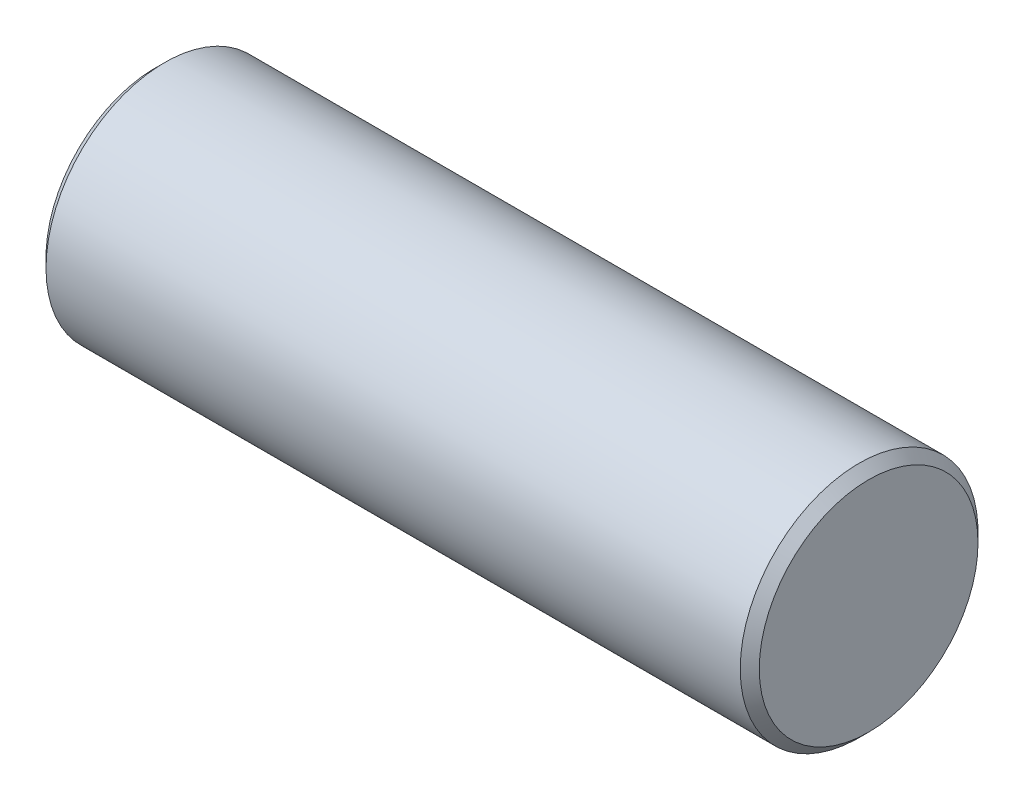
from build123d import *

# Parameters (mm, degrees)
SKETCH1_R           = 3.175
BOSS_EXTRUDE1_DEPTH = 19.05
CHAMFER1_SIZE       = 0.254


with BuildPart() as part:
    # Sketch1 → Boss-Extrude1 (new body)
    with BuildSketch(Plane(origin=(0, 0, 0), x_dir=(0, 0, -1), z_dir=(1, 0, 0))):
        with Locations(Location((0, 0, 0), (0, 0, 180))):
            Circle(SKETCH1_R)
    extrude(amount=BOSS_EXTRUDE1_DEPTH)

    # Chamfer1
    chamfer1_edges = [part.edges().sort_by_distance(p)[0] for p in [
        (0, 0, -3.175),
        (19.05, 0, -3.175),
    ]]
    chamfer(chamfer1_edges, length=CHAMFER1_SIZE)


solid = part.part
